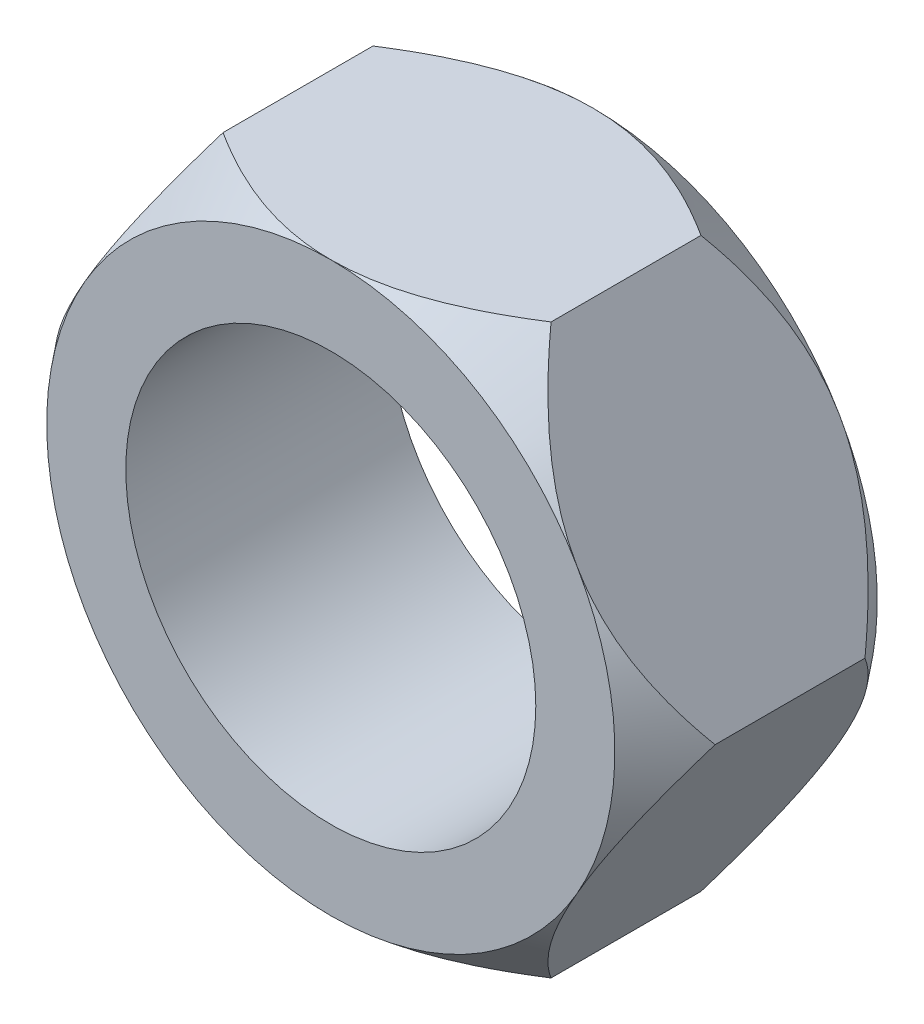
from build123d import *

# Parameters (mm, degrees)
SKETCH1_R               = 3.175
BOSS_EXTRUDE1_DEPTH     = 2.032
SKETCH2_OUTSIDE_W       = 22.906
SKETCH2_OUTSIDE_H       = 21.544
SKETCH2_OUTSIDE_R       = 4.399409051
CUT_EXTRUDE1_DEPTH      = 5.08
CUT_EXTRUDE1_DRAFT      = -38
MIRROR1_COPY_1_SKETCH_W = 22.906
MIRROR1_COPY_1_SKETCH_H = 21.544
MIRROR1_COPY_1_SKETCH_R = 4.399409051
MIRROR1_COPY_1_DEPTH    = 5.08
MIRROR1_COPY_1_DRAFT    = -38


with BuildPart() as part:
    # Sketch1 → Boss-Extrude1 (new, symmetric)
    with BuildSketch(Plane.XY):
        Polygon((2.54, 4.399409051), (-2.54, 4.399409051), (-5.08, 0), (-2.54, -4.399409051), (2.54, -4.399409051), (5.08, 0), align=None)
        Circle(SKETCH1_R, mode=Mode.SUBTRACT)
    extrude(amount=BOSS_EXTRUDE1_DEPTH, both=True)


with BuildPart() as cut_extrude1_tool:
    # Sketch2 outside → Cut-Extrude1 (with draft: the straight prism first)
    with BuildSketch(Plane.XY.offset(2.032)):
        Rectangle(SKETCH2_OUTSIDE_W, SKETCH2_OUTSIDE_H)
        Circle(SKETCH2_OUTSIDE_R, mode=Mode.SUBTRACT)
    extrude(amount=-CUT_EXTRUDE1_DEPTH)
    # Cut-Extrude1: the draft: its side faces are tilted about the plane it starts from
    cut_extrude1_sides = [cut_extrude1_tool.faces().sort_by_distance(p)[0] for p in [
        (0, -10.772, -0.508),
        (11.453, 0, -0.508),
        (0, 10.772, -0.508),
        (-11.453, 0, -0.508),
        (-4.399409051, 0, -0.508),
    ]]
    draft(cut_extrude1_sides, Plane.XY.offset(2.032), CUT_EXTRUDE1_DRAFT)


with BuildPart() as part_1:
    add(part.part)

    # Cut-Extrude1: cut by cut_extrude1_tool
    add(cut_extrude1_tool.part, mode=Mode.SUBTRACT)


with BuildPart() as mirror1_copy_1_tool:
    # Mirror1 copy 1 sketch → Mirror1 copy 1 (with draft: the straight prism first)
    with BuildSketch(Plane(origin=(0, 0, -2.032), x_dir=(1, 0, 0), z_dir=(0, 0, -1))):
        Rectangle(MIRROR1_COPY_1_SKETCH_W, MIRROR1_COPY_1_SKETCH_H)
        Circle(MIRROR1_COPY_1_SKETCH_R, mode=Mode.SUBTRACT)
    extrude(amount=-MIRROR1_COPY_1_DEPTH)
    # Mirror1 copy 1: the draft: its side faces are tilted about the plane it starts from
    mirror1_copy_1_sides = [mirror1_copy_1_tool.faces().sort_by_distance(p)[0] for p in [
        (0, -10.772, 0.508),
        (11.453, 0, 0.508),
        (0, 10.772, 0.508),
        (-11.453, 0, 0.508),
        (-4.399409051, 0, 0.508),
    ]]
    draft(mirror1_copy_1_sides, Plane(origin=(0, 0, -2.032), x_dir=(1, 0, 0), z_dir=(0, 0, -1)), MIRROR1_COPY_1_DRAFT)


with BuildPart() as part_2:
    add(part_1.part)

    # Mirror1 copy 1: cut by mirror1_copy_1_tool
    add(mirror1_copy_1_tool.part, mode=Mode.SUBTRACT)


solid = part_2.part
